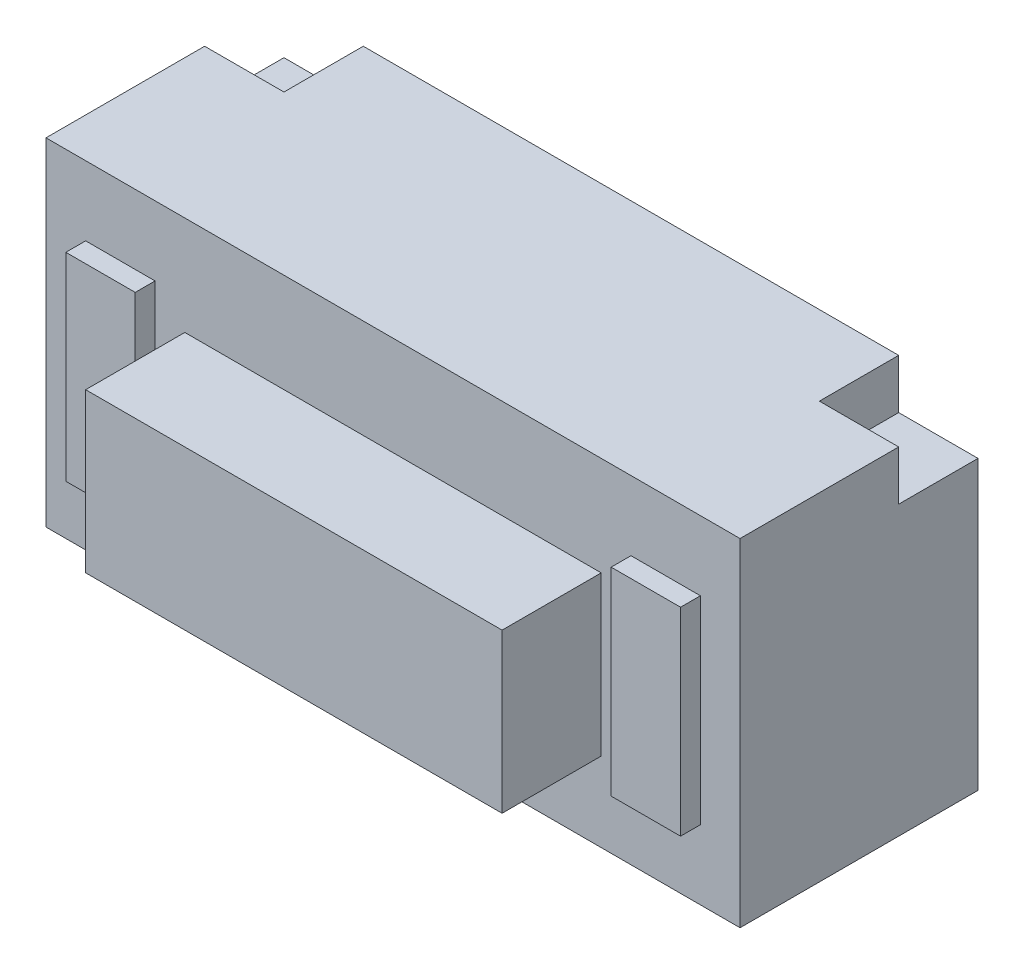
from build123d import *

# Parameters (mm, degrees)
ESQUISSE1_W             = 7
ESQUISSE1_H             = 2.4
BOSS_EXTRU_1_DEPTH      = 3.4
ESQUISSE2_W             = 0.8
ESQUISSE2_H             = 0.8
ENL_V_MAT_EXTRU_1_DEPTH = 0.5
ESQUISSE3_W             = 0.7
ESQUISSE3_H             = 2
ESQUISSE3_W_2           = 4.2
ESQUISSE3_H_2           = 1.6
BOSS_EXTRU_2_DEPTH      = 0.2
ESQUISSE4_W             = 4.2
ESQUISSE4_H             = 1.6
BOSS_EXTRU_3_DEPTH      = 0.8


with BuildPart() as part:
    # Esquisse1 → Boss.-Extru.1 (new body)
    with BuildSketch(Plane(origin=(0, 0, 0), x_dir=(1, 0, 0), z_dir=(0, 1, 0))):
        Rectangle(ESQUISSE1_W, ESQUISSE1_H)
    extrude(amount=BOSS_EXTRU_1_DEPTH)

    # Esquisse2 → Enl_v. mat.-Extru.1 (cut)
    with BuildSketch(Plane(origin=(0, 3.4, 0), x_dir=(1, 0, 0), z_dir=(0, 1, 0))):
        with Locations((-3.1, 0.8)):
            Rectangle(ESQUISSE2_W, ESQUISSE2_H)
        with Locations((3.1, 0.8)):
            Rectangle(ESQUISSE2_W, ESQUISSE2_H)
    extrude(amount=-ENL_V_MAT_EXTRU_1_DEPTH, mode=Mode.SUBTRACT)

    # Esquisse3 → Boss.-Extru.2 (add)
    with BuildSketch(Plane.XY.offset(1.2)):
        with Locations((-2.75, 1.7)):
            Rectangle(ESQUISSE3_W, ESQUISSE3_H)
        with Locations((0, 1.6)):
            Rectangle(ESQUISSE3_W_2, ESQUISSE3_H_2)
        with Locations((2.75, 1.7)):
            Rectangle(ESQUISSE3_W, ESQUISSE3_H)
    extrude(amount=BOSS_EXTRU_2_DEPTH)

    # Esquisse4 → Boss.-Extru.3 (add)
    with BuildSketch(Plane.XY.offset(1.4)):
        with Locations((0, 1.6)):
            Rectangle(ESQUISSE4_W, ESQUISSE4_H)
    extrude(amount=BOSS_EXTRU_3_DEPTH)


solid = part.part
